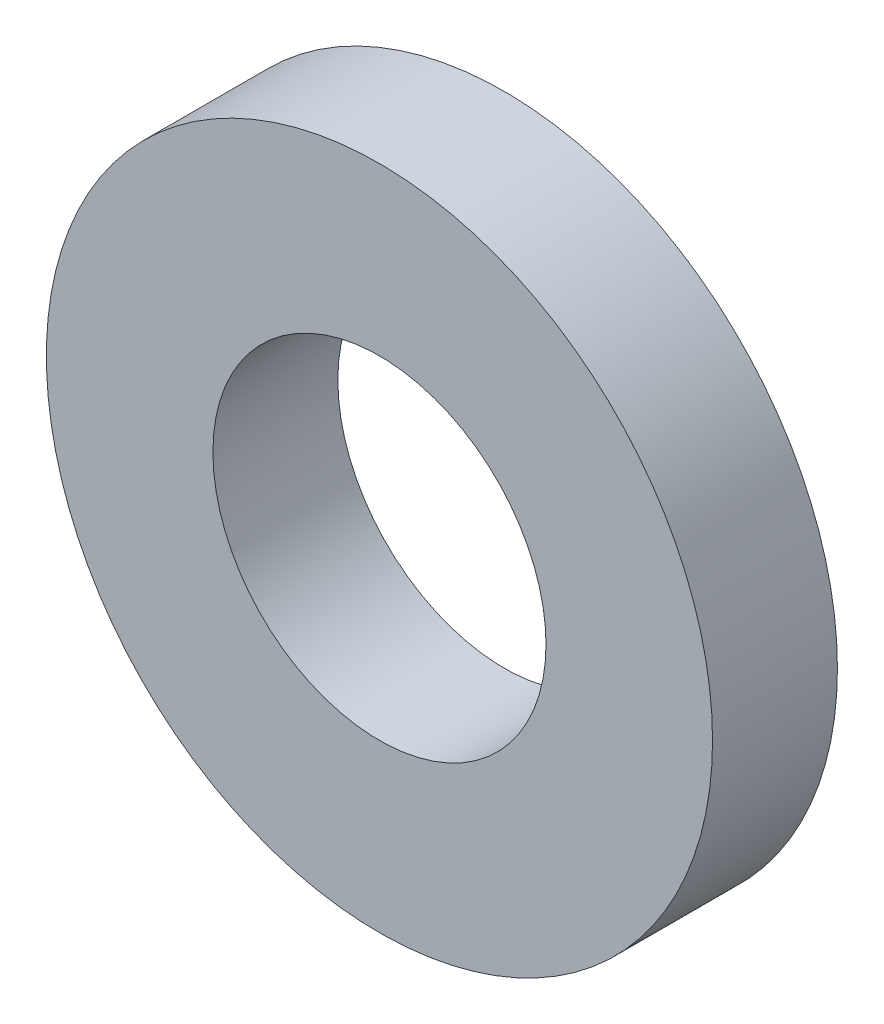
ISO-10303-21;
HEADER;
FILE_DESCRIPTION(('STEP AP214'),'2;1');
FILE_NAME('part.step','',(''),(''),'','','');
FILE_SCHEMA(('AUTOMOTIVE_DESIGN { 1 0 10303 214 1 1 1 1 }'));
ENDSEC;
DATA;
#1=APPLICATION_CONTEXT('core data for automotive mechanical design processes');
#2=APPLICATION_PROTOCOL_DEFINITION('international standard','automotive_design',2000,#1);
#3=PRODUCT_CONTEXT('',#1,'mechanical');
#4=PRODUCT('Part','Part','',(#3));
#5=PRODUCT_RELATED_PRODUCT_CATEGORY('part','',(#4));
#6=PRODUCT_DEFINITION_FORMATION('','',#4);
#7=PRODUCT_DEFINITION_CONTEXT('part definition',#1,'design');
#8=PRODUCT_DEFINITION('design','',#6,#7);
#9=PRODUCT_DEFINITION_SHAPE('','',#8);
#10=(LENGTH_UNIT() NAMED_UNIT(*) SI_UNIT(.MILLI.,.METRE.));
#11=(NAMED_UNIT(*) PLANE_ANGLE_UNIT() SI_UNIT($,.RADIAN.));
#12=(NAMED_UNIT(*) SI_UNIT($,.STERADIAN.) SOLID_ANGLE_UNIT());
#13=UNCERTAINTY_MEASURE_WITH_UNIT(LENGTH_MEASURE(1.E-05),#10,'distance_accuracy_value','');
#14=(GEOMETRIC_REPRESENTATION_CONTEXT(3) GLOBAL_UNCERTAINTY_ASSIGNED_CONTEXT((#13)) GLOBAL_UNIT_ASSIGNED_CONTEXT((#10,
#11,#12)) REPRESENTATION_CONTEXT('',''));
#15=CARTESIAN_POINT('',(0.,0.,0.));
#16=DIRECTION('',(0.,0.,1.));
#17=DIRECTION('',(1.,0.,0.));
#18=AXIS2_PLACEMENT_3D('',#15,#16,#17);
#19=CARTESIAN_POINT('',(39.,44.,-1.5));
#20=DIRECTION('',(0.,0.,1.));
#21=DIRECTION('',(1.,0.,0.));
#22=AXIS2_PLACEMENT_3D('',#19,#20,#21);
#23=CYLINDRICAL_SURFACE('',#22,4.);
#24=CARTESIAN_POINT('',(39.,44.,-1.5));
#25=DIRECTION('',(0.,0.,1.));
#26=DIRECTION('',(1.,0.,0.));
#27=AXIS2_PLACEMENT_3D('',#24,#25,#26);
#28=CIRCLE('',#27,4.);
#29=CARTESIAN_POINT('',(43.,44.,-1.5));
#30=VERTEX_POINT('',#29);
#31=EDGE_CURVE('E10',#30,#30,#28,.T.);
#32=ORIENTED_EDGE('',*,*,#31,.T.);
#33=EDGE_LOOP('',(#32));
#34=FACE_BOUND('',#33,.T.);
#35=CARTESIAN_POINT('',(39.,44.,0.));
#36=DIRECTION('',(0.,0.,1.));
#37=DIRECTION('',(1.,0.,0.));
#38=AXIS2_PLACEMENT_3D('',#35,#36,#37);
#39=CIRCLE('',#38,4.);
#40=CARTESIAN_POINT('',(43.,44.,0.));
#41=VERTEX_POINT('',#40);
#42=EDGE_CURVE('E34',#41,#41,#39,.T.);
#43=ORIENTED_EDGE('',*,*,#42,.F.);
#44=EDGE_LOOP('',(#43));
#45=FACE_BOUND('',#44,.T.);
#46=ADVANCED_FACE('F31',(#34,#45),#23,.T.);
#47=CARTESIAN_POINT('',(39.,44.,-1.5));
#48=DIRECTION('',(0.,0.,1.));
#49=DIRECTION('',(1.,0.,0.));
#50=AXIS2_PLACEMENT_3D('',#47,#48,#49);
#51=PLANE('',#50);
#52=CARTESIAN_POINT('',(39.,44.,-1.5));
#53=DIRECTION('',(0.,0.,1.));
#54=DIRECTION('',(1.,0.,0.));
#55=AXIS2_PLACEMENT_3D('',#52,#53,#54);
#56=CIRCLE('',#55,2.);
#57=CARTESIAN_POINT('',(41.,44.,-1.5));
#58=VERTEX_POINT('',#57);
#59=EDGE_CURVE('E41',#58,#58,#56,.T.);
#60=ORIENTED_EDGE('',*,*,#59,.T.);
#61=EDGE_LOOP('',(#60));
#62=FACE_BOUND('',#61,.T.);
#63=ORIENTED_EDGE('',*,*,#31,.F.);
#64=EDGE_LOOP('',(#63));
#65=FACE_BOUND('',#64,.T.);
#66=ADVANCED_FACE('F49',(#62,#65),#51,.F.);
#67=CARTESIAN_POINT('',(39.,44.,0.));
#68=DIRECTION('',(0.,0.,1.));
#69=DIRECTION('',(1.,0.,0.));
#70=AXIS2_PLACEMENT_3D('',#67,#68,#69);
#71=PLANE('',#70);
#72=CARTESIAN_POINT('',(39.,44.,0.));
#73=DIRECTION('',(0.,0.,1.));
#74=DIRECTION('',(1.,0.,0.));
#75=AXIS2_PLACEMENT_3D('',#72,#73,#74);
#76=CIRCLE('',#75,2.);
#77=CARTESIAN_POINT('',(41.,44.,0.));
#78=VERTEX_POINT('',#77);
#79=EDGE_CURVE('E43',#78,#78,#76,.T.);
#80=ORIENTED_EDGE('',*,*,#79,.F.);
#81=EDGE_LOOP('',(#80));
#82=FACE_BOUND('',#81,.T.);
#83=ORIENTED_EDGE('',*,*,#42,.T.);
#84=EDGE_LOOP('',(#83));
#85=FACE_BOUND('',#84,.T.);
#86=ADVANCED_FACE('F55',(#82,#85),#71,.T.);
#87=CARTESIAN_POINT('',(39.,44.,-1.5));
#88=DIRECTION('',(0.,0.,1.));
#89=DIRECTION('',(1.,0.,0.));
#90=AXIS2_PLACEMENT_3D('',#87,#88,#89);
#91=CYLINDRICAL_SURFACE('',#90,2.);
#92=ORIENTED_EDGE('',*,*,#59,.F.);
#93=EDGE_LOOP('',(#92));
#94=FACE_BOUND('',#93,.T.);
#95=ORIENTED_EDGE('',*,*,#79,.T.);
#96=EDGE_LOOP('',(#95));
#97=FACE_BOUND('',#96,.T.);
#98=ADVANCED_FACE('F52',(#94,#97),#91,.F.);
#99=CLOSED_SHELL('',(#46,#66,#86,#98));
#100=MANIFOLD_SOLID_BREP('B2',#99);
#101=ADVANCED_BREP_SHAPE_REPRESENTATION('',(#18,#100),#14);
#102=SHAPE_DEFINITION_REPRESENTATION(#9,#101);
ENDSEC;
END-ISO-10303-21;
